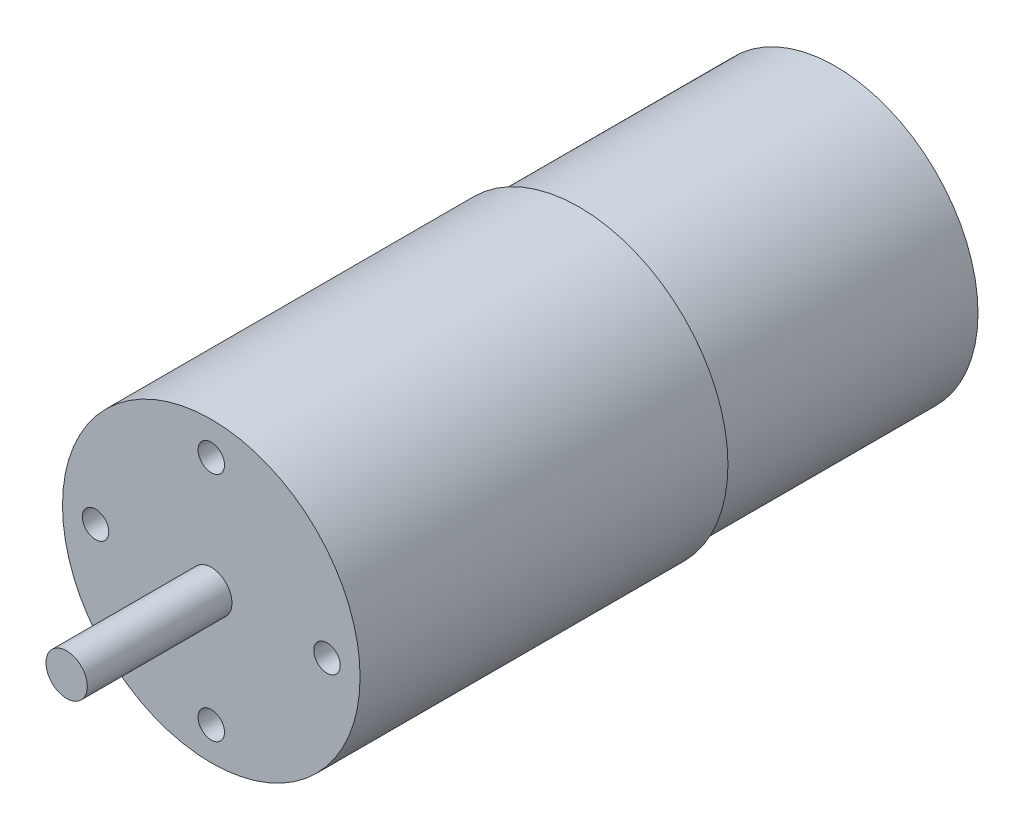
from build123d import *

# Parameters (mm, degrees)
SKETCH_1_R          = 17.25
EXTRUDE_1_DEPTH     = 31
SKETCH_2_R          = 18
EXTRUDE_2_DEPTH     = 44.5
SKETCH_3_R          = 2.5
EXTRUDE_3_DEPTH     = 17.5
SKETCH_4_R          = 1.6
CUT_EXTRUDE_1_DEPTH = 5
SKETCH_6_R          = 0.75
EXTRUDE_4_DEPTH     = 0.5


with BuildPart() as part:
    # Sketch 1 → Extrude 1 (new body)
    with BuildSketch(Plane.XY):
        Circle(SKETCH_1_R)
    extrude(amount=EXTRUDE_1_DEPTH)

    # Sketch 2 → Extrude 2 (add)
    with BuildSketch(Plane.XY.offset(31)):
        Circle(SKETCH_2_R)
    extrude(amount=EXTRUDE_2_DEPTH)

    # Sketch 3 → Extrude 3 (add)
    with BuildSketch(Plane.XY.offset(75.5)):
        Circle(SKETCH_3_R)
    extrude(amount=EXTRUDE_3_DEPTH)

    # Sketch 4 → Cut-Extrude 1 (cut)
    with BuildSketch(Plane.XY.offset(75.5)):
        with Locations((0, 14)):
            Circle(SKETCH_4_R)
        with Locations((14, 0)):
            Circle(SKETCH_4_R)
        with Locations((0, -14)):
            Circle(SKETCH_4_R)
        with Locations((-14, 0)):
            Circle(SKETCH_4_R)
    extrude(amount=-CUT_EXTRUDE_1_DEPTH, mode=Mode.SUBTRACT)

    # Sketch 6 → Extrude 4 (add, symmetric)
    # profile 1 of 2: a face of its own
    with BuildSketch(Plane(origin=(0, 0, 0), x_dir=(1, 0, 0), z_dir=(0, 1, 0))):
        with BuildLine():
            Line((-11, 2), (-11, 0))
            Line((-11, 0), (-9, 0))
            Line((-9, 0), (-9, 2))
            ThreePointArc((-9, 2), (-10, 3), (-11, 2))
        make_face()
        with Locations(Location((-10, 2, 0), (0, 0, 270))):
            Circle(SKETCH_6_R, mode=Mode.SUBTRACT)
    # profile 2 of 2: a face of its own
    with BuildSketch(Plane(origin=(0, 0, 0), x_dir=(1, 0, 0), z_dir=(0, 1, 0))):
        with BuildLine():
            Line((9, 0), (9, 2))
            ThreePointArc((9, 2), (10, 3), (11, 2))
            Line((11, 2), (11, 0))
            Line((11, 0), (9, 0))
        make_face()
        with Locations(Location((10, 2, 0), (0, 0, 90))):
            Circle(SKETCH_6_R, mode=Mode.SUBTRACT)
    extrude(amount=EXTRUDE_4_DEPTH, both=True)


solid = part.part
